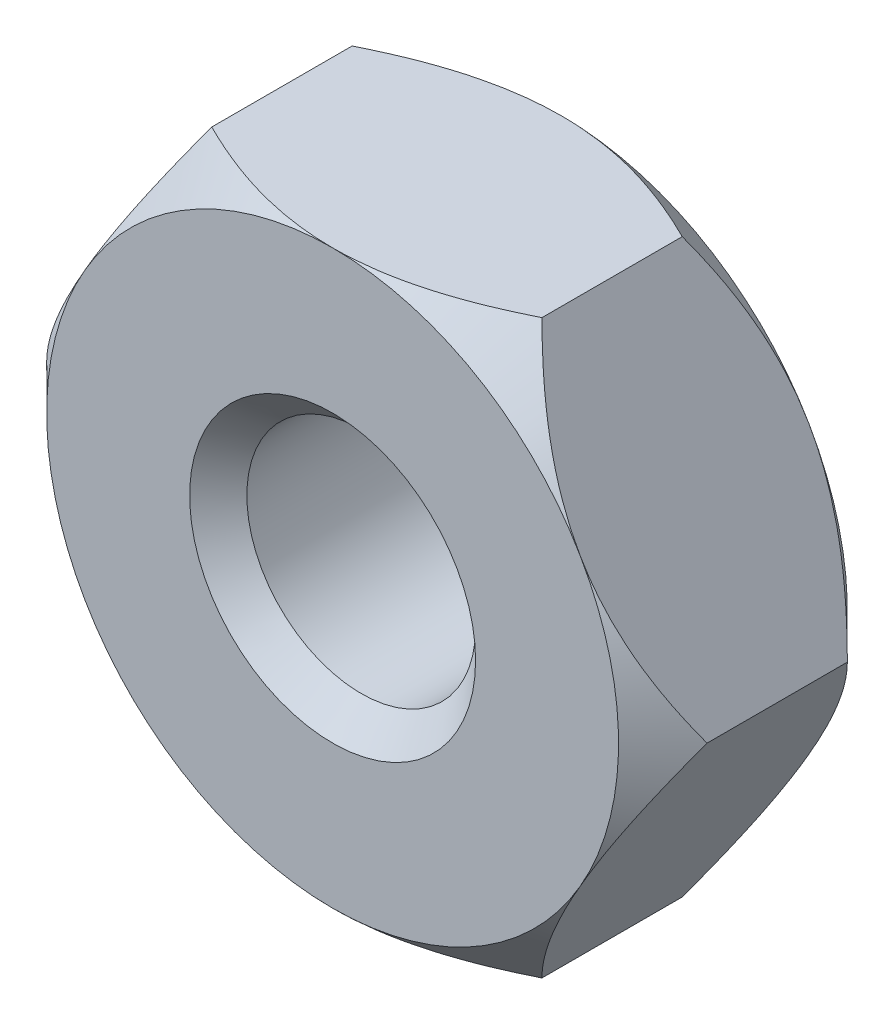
ISO-10303-21;
HEADER;
FILE_DESCRIPTION(('STEP AP214'),'2;1');
FILE_NAME('part.step','',(''),(''),'','','');
FILE_SCHEMA(('AUTOMOTIVE_DESIGN { 1 0 10303 214 1 1 1 1 }'));
ENDSEC;
DATA;
#1=APPLICATION_CONTEXT('core data for automotive mechanical design processes');
#2=APPLICATION_PROTOCOL_DEFINITION('international standard','automotive_design',2000,#1);
#3=PRODUCT_CONTEXT('',#1,'mechanical');
#4=PRODUCT('Part','Part','',(#3));
#5=PRODUCT_RELATED_PRODUCT_CATEGORY('part','',(#4));
#6=PRODUCT_DEFINITION_FORMATION('','',#4);
#7=PRODUCT_DEFINITION_CONTEXT('part definition',#1,'design');
#8=PRODUCT_DEFINITION('design','',#6,#7);
#9=PRODUCT_DEFINITION_SHAPE('','',#8);
#10=(LENGTH_UNIT() NAMED_UNIT(*) SI_UNIT(.MILLI.,.METRE.));
#11=(NAMED_UNIT(*) PLANE_ANGLE_UNIT() SI_UNIT($,.RADIAN.));
#12=(NAMED_UNIT(*) SI_UNIT($,.STERADIAN.) SOLID_ANGLE_UNIT());
#13=UNCERTAINTY_MEASURE_WITH_UNIT(LENGTH_MEASURE(1.E-05),#10,'distance_accuracy_value','');
#14=(GEOMETRIC_REPRESENTATION_CONTEXT(3) GLOBAL_UNCERTAINTY_ASSIGNED_CONTEXT((#13)) GLOBAL_UNIT_ASSIGNED_CONTEXT((#10,
#11,#12)) REPRESENTATION_CONTEXT('',''));
#15=CARTESIAN_POINT('',(0.,0.,0.));
#16=DIRECTION('',(0.,0.,1.));
#17=DIRECTION('',(1.,0.,0.));
#18=AXIS2_PLACEMENT_3D('',#15,#16,#17);
#19=CARTESIAN_POINT('',(1.15470053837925,-2.,0.8));
#20=DIRECTION('',(-0.866025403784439,0.5,0.));
#21=DIRECTION('',(-0.5,-0.866025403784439,0.));
#22=AXIS2_PLACEMENT_3D('',#19,#20,#21);
#23=PLANE('',#22);
#24=DIRECTION('',(0.,0.,-1.));
#25=VECTOR('',#24,1.);
#26=CARTESIAN_POINT('',(1.15470053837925,-2.,0.8));
#27=LINE('',#26,#25);
#28=CARTESIAN_POINT('',(1.15470053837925,-2.,0.490598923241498));
#29=VERTEX_POINT('',#28);
#30=CARTESIAN_POINT('',(1.15470053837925,-2.,-0.490598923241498));
#31=VERTEX_POINT('',#30);
#32=EDGE_CURVE('E268',#29,#31,#27,.T.);
#33=ORIENTED_EDGE('',*,*,#32,.T.);
#34=CARTESIAN_POINT('',(1.15458506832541,-2.0002,-0.490483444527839));
#35=CARTESIAN_POINT('',(1.19427965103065,-1.93144696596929,-0.530145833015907));
#36=CARTESIAN_POINT('',(1.23463799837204,-1.86154425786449,-0.567478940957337));
#37=CARTESIAN_POINT('',(1.31693321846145,-1.71900475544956,-0.635835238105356));
#38=CARTESIAN_POINT('',(1.35887791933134,-1.64635440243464,-0.666820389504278));
#39=CARTESIAN_POINT('',(1.44345742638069,-1.49985839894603,-0.719898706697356));
#40=CARTESIAN_POINT('',(1.48607068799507,-1.42605006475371,-0.742125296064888));
#41=CARTESIAN_POINT('',(1.57223542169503,-1.27680836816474,-0.776370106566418));
#42=CARTESIAN_POINT('',(1.61578426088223,-1.20137956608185,-0.788413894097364));
#43=CARTESIAN_POINT('',(1.69083694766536,-1.07138449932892,-0.799280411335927));
#44=CARTESIAN_POINT('',(1.72224381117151,-1.01698621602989,-0.800889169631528));
#45=CARTESIAN_POINT('',(1.78500621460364,-0.908278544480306,-0.798180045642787));
#46=CARTESIAN_POINT('',(1.81636173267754,-0.85396919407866,-0.793860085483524));
#47=CARTESIAN_POINT('',(1.87877671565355,-0.745863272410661,-0.779539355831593));
#48=CARTESIAN_POINT('',(1.90983580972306,-0.692067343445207,-0.769532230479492));
#49=CARTESIAN_POINT('',(1.97141691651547,-0.585405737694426,-0.744386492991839));
#50=CARTESIAN_POINT('',(2.00193897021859,-0.532539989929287,-0.729248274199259));
#51=CARTESIAN_POINT('',(2.08012358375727,-0.397120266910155,-0.684304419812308));
#52=CARTESIAN_POINT('',(2.12730124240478,-0.315406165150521,-0.651110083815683));
#53=CARTESIAN_POINT('',(2.19667172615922,-0.195252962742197,-0.595073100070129));
#54=CARTESIAN_POINT('',(2.21953238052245,-0.155657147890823,-0.575384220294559));
#55=CARTESIAN_POINT('',(2.26483018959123,-0.0771990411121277,-0.534211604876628));
#56=CARTESIAN_POINT('',(2.28726759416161,-0.0383363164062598,-0.512728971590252));
#57=CARTESIAN_POINT('',(2.30951654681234,0.000199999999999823,-0.490483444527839));
#58=B_SPLINE_CURVE_WITH_KNOTS('',3,(#34,#35,#36,#37,#38,#39,#40,#41,#42,#43,#44,#45,#46,#47,#48,
#49,#50,#51,#52,#53,#54,#55,#56,#57),.UNSPECIFIED.,.F.,.F.,(4,2,2,2,2,2,2,2,2,2,2,4),(0.,
0.266420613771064,0.534393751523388,0.798110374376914,1.06116288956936,1.24939906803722,
1.43770123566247,1.62621426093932,1.81471283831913,2.11415604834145,2.2634717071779,
2.41269626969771),.UNSPECIFIED.);
#59=CARTESIAN_POINT('',(1.73205080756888,-1.,-0.8));
#60=VERTEX_POINT('',#59);
#61=EDGE_CURVE('E60',#31,#60,#58,.T.);
#62=ORIENTED_EDGE('',*,*,#61,.T.);
#63=CARTESIAN_POINT('',(2.3094010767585,0.,-0.490598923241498));
#64=VERTEX_POINT('',#63);
#65=EDGE_CURVE('E148',#60,#64,#58,.T.);
#66=ORIENTED_EDGE('',*,*,#65,.T.);
#67=DIRECTION('',(0.,0.,-1.));
#68=VECTOR('',#67,1.);
#69=CARTESIAN_POINT('',(2.3094010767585,0.,0.8));
#70=LINE('',#69,#68);
#71=CARTESIAN_POINT('',(2.3094010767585,0.,0.490598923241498));
#72=VERTEX_POINT('',#71);
#73=EDGE_CURVE('E162',#72,#64,#70,.T.);
#74=ORIENTED_EDGE('',*,*,#73,.F.);
#75=CARTESIAN_POINT('',(1.15458506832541,-2.0002,0.490483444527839));
#76=CARTESIAN_POINT('',(1.19427965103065,-1.93144696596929,0.530145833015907));
#77=CARTESIAN_POINT('',(1.23463799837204,-1.86154425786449,0.567478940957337));
#78=CARTESIAN_POINT('',(1.31693321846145,-1.71900475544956,0.635835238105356));
#79=CARTESIAN_POINT('',(1.35887791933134,-1.64635440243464,0.666820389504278));
#80=CARTESIAN_POINT('',(1.44345742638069,-1.49985839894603,0.719898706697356));
#81=CARTESIAN_POINT('',(1.48607068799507,-1.42605006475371,0.742125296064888));
#82=CARTESIAN_POINT('',(1.57223542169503,-1.27680836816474,0.776370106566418));
#83=CARTESIAN_POINT('',(1.61578426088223,-1.20137956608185,0.788413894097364));
#84=CARTESIAN_POINT('',(1.69083694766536,-1.07138449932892,0.799280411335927));
#85=CARTESIAN_POINT('',(1.72224381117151,-1.01698621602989,0.800889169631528));
#86=CARTESIAN_POINT('',(1.78500621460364,-0.908278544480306,0.798180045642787));
#87=CARTESIAN_POINT('',(1.81636173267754,-0.85396919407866,0.793860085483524));
#88=CARTESIAN_POINT('',(1.87877671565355,-0.745863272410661,0.779539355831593));
#89=CARTESIAN_POINT('',(1.90983580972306,-0.692067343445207,0.769532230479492));
#90=CARTESIAN_POINT('',(1.97141691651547,-0.585405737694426,0.744386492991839));
#91=CARTESIAN_POINT('',(2.00193897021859,-0.532539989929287,0.729248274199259));
#92=CARTESIAN_POINT('',(2.08012358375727,-0.397120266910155,0.684304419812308));
#93=CARTESIAN_POINT('',(2.12730124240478,-0.315406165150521,0.651110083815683));
#94=CARTESIAN_POINT('',(2.19667172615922,-0.195252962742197,0.595073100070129));
#95=CARTESIAN_POINT('',(2.21953238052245,-0.155657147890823,0.575384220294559));
#96=CARTESIAN_POINT('',(2.26483018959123,-0.0771990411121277,0.534211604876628));
#97=CARTESIAN_POINT('',(2.28726759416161,-0.0383363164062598,0.512728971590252));
#98=CARTESIAN_POINT('',(2.30951654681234,0.000199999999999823,0.490483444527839));
#99=B_SPLINE_CURVE_WITH_KNOTS('',3,(#75,#76,#77,#78,#79,#80,#81,#82,#83,#84,#85,#86,#87,#88,#89,
#90,#91,#92,#93,#94,#95,#96,#97,#98),.UNSPECIFIED.,.F.,.F.,(4,2,2,2,2,2,2,2,2,2,2,4),(0.,
0.266420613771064,0.534393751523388,0.798110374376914,1.06116288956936,1.24939906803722,
1.43770123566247,1.62621426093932,1.81471283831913,2.11415604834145,2.2634717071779,
2.41269626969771),.UNSPECIFIED.);
#100=CARTESIAN_POINT('',(1.73205080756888,-1.,0.8));
#101=VERTEX_POINT('',#100);
#102=EDGE_CURVE('E261',#101,#72,#99,.T.);
#103=ORIENTED_EDGE('',*,*,#102,.F.);
#104=EDGE_CURVE('E267',#29,#101,#99,.T.);
#105=ORIENTED_EDGE('',*,*,#104,.F.);
#106=EDGE_LOOP('',(#33,#62,#66,#74,#103,#105));
#107=FACE_BOUND('',#106,.T.);
#108=ADVANCED_FACE('F41',(#107),#23,.F.);
#109=CARTESIAN_POINT('',(2.3094010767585,0.,0.8));
#110=DIRECTION('',(-0.866025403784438,-0.5,0.));
#111=DIRECTION('',(0.5,-0.866025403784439,0.));
#112=AXIS2_PLACEMENT_3D('',#109,#110,#111);
#113=PLANE('',#112);
#114=ORIENTED_EDGE('',*,*,#73,.T.);
#115=CARTESIAN_POINT('',(2.30951654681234,-0.000199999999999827,-0.490483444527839));
#116=CARTESIAN_POINT('',(2.26982196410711,0.0685530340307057,-0.530145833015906));
#117=CARTESIAN_POINT('',(2.22946361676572,0.138455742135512,-0.567478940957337));
#118=CARTESIAN_POINT('',(2.1471683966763,0.280995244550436,-0.635835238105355));
#119=CARTESIAN_POINT('',(2.10522369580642,0.353645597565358,-0.666820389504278));
#120=CARTESIAN_POINT('',(2.02064418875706,0.500141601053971,-0.719898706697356));
#121=CARTESIAN_POINT('',(1.97803092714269,0.573949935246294,-0.742125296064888));
#122=CARTESIAN_POINT('',(1.89186619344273,0.723191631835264,-0.776370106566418));
#123=CARTESIAN_POINT('',(1.84831735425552,0.798620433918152,-0.788413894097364));
#124=CARTESIAN_POINT('',(1.7732646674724,0.928615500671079,-0.799280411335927));
#125=CARTESIAN_POINT('',(1.74185780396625,0.983013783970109,-0.800889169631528));
#126=CARTESIAN_POINT('',(1.67909540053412,1.09172145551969,-0.798180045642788));
#127=CARTESIAN_POINT('',(1.64773988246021,1.14603080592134,-0.793860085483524));
#128=CARTESIAN_POINT('',(1.5853248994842,1.25413672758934,-0.779539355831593));
#129=CARTESIAN_POINT('',(1.55426580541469,1.30793265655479,-0.769532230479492));
#130=CARTESIAN_POINT('',(1.49268469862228,1.41459426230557,-0.744386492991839));
#131=CARTESIAN_POINT('',(1.46216264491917,1.46746001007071,-0.729248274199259));
#132=CARTESIAN_POINT('',(1.38397803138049,1.60287973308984,-0.684304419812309));
#133=CARTESIAN_POINT('',(1.33680037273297,1.68459383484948,-0.651110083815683));
#134=CARTESIAN_POINT('',(1.26742988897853,1.8047470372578,-0.595073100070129));
#135=CARTESIAN_POINT('',(1.24456923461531,1.84434285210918,-0.575384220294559));
#136=CARTESIAN_POINT('',(1.19927142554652,1.92280095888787,-0.534211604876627));
#137=CARTESIAN_POINT('',(1.17683402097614,1.96166368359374,-0.512728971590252));
#138=CARTESIAN_POINT('',(1.15458506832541,2.0002,-0.490483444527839));
#139=B_SPLINE_CURVE_WITH_KNOTS('',3,(#115,#116,#117,#118,#119,#120,#121,#122,#123,#124,#125,
#126,#127,#128,#129,#130,#131,#132,#133,#134,#135,#136,#137,#138),.UNSPECIFIED.,.F.,.F.,(4,2,2,
2,2,2,2,2,2,2,2,4),(0.,0.266420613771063,0.534393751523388,0.798110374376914,1.06116288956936,
1.24939906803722,1.43770123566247,1.62621426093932,1.81471283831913,2.11415604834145,
2.2634717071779,2.41269626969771),.UNSPECIFIED.);
#140=CARTESIAN_POINT('',(1.73205080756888,1.,-0.8));
#141=VERTEX_POINT('',#140);
#142=EDGE_CURVE('E141',#64,#141,#139,.T.);
#143=ORIENTED_EDGE('',*,*,#142,.T.);
#144=CARTESIAN_POINT('',(1.15470053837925,2.,-0.490598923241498));
#145=VERTEX_POINT('',#144);
#146=EDGE_CURVE('E129',#141,#145,#139,.T.);
#147=ORIENTED_EDGE('',*,*,#146,.T.);
#148=DIRECTION('',(0.,0.,-1.));
#149=VECTOR('',#148,1.);
#150=CARTESIAN_POINT('',(1.15470053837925,2.,0.8));
#151=LINE('',#150,#149);
#152=CARTESIAN_POINT('',(1.15470053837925,2.,0.490598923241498));
#153=VERTEX_POINT('',#152);
#154=EDGE_CURVE('E304',#153,#145,#151,.T.);
#155=ORIENTED_EDGE('',*,*,#154,.F.);
#156=CARTESIAN_POINT('',(2.30951654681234,-0.000199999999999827,0.490483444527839));
#157=CARTESIAN_POINT('',(2.26982196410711,0.0685530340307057,0.530145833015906));
#158=CARTESIAN_POINT('',(2.22946361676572,0.138455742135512,0.567478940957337));
#159=CARTESIAN_POINT('',(2.1471683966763,0.280995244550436,0.635835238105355));
#160=CARTESIAN_POINT('',(2.10522369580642,0.353645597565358,0.666820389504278));
#161=CARTESIAN_POINT('',(2.02064418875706,0.500141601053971,0.719898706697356));
#162=CARTESIAN_POINT('',(1.97803092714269,0.573949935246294,0.742125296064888));
#163=CARTESIAN_POINT('',(1.89186619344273,0.723191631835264,0.776370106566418));
#164=CARTESIAN_POINT('',(1.84831735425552,0.798620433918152,0.788413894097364));
#165=CARTESIAN_POINT('',(1.7732646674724,0.928615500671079,0.799280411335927));
#166=CARTESIAN_POINT('',(1.74185780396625,0.983013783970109,0.800889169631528));
#167=CARTESIAN_POINT('',(1.67909540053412,1.09172145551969,0.798180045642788));
#168=CARTESIAN_POINT('',(1.64773988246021,1.14603080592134,0.793860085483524));
#169=CARTESIAN_POINT('',(1.5853248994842,1.25413672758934,0.779539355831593));
#170=CARTESIAN_POINT('',(1.55426580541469,1.30793265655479,0.769532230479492));
#171=CARTESIAN_POINT('',(1.49268469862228,1.41459426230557,0.744386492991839));
#172=CARTESIAN_POINT('',(1.46216264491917,1.46746001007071,0.729248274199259));
#173=CARTESIAN_POINT('',(1.38397803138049,1.60287973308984,0.684304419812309));
#174=CARTESIAN_POINT('',(1.33680037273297,1.68459383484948,0.651110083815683));
#175=CARTESIAN_POINT('',(1.26742988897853,1.8047470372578,0.595073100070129));
#176=CARTESIAN_POINT('',(1.24456923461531,1.84434285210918,0.575384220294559));
#177=CARTESIAN_POINT('',(1.19927142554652,1.92280095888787,0.534211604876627));
#178=CARTESIAN_POINT('',(1.17683402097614,1.96166368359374,0.512728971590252));
#179=CARTESIAN_POINT('',(1.15458506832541,2.0002,0.490483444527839));
#180=B_SPLINE_CURVE_WITH_KNOTS('',3,(#156,#157,#158,#159,#160,#161,#162,#163,#164,#165,#166,
#167,#168,#169,#170,#171,#172,#173,#174,#175,#176,#177,#178,#179),.UNSPECIFIED.,.F.,.F.,(4,2,2,
2,2,2,2,2,2,2,2,4),(0.,0.266420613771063,0.534393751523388,0.798110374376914,1.06116288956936,
1.24939906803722,1.43770123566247,1.62621426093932,1.81471283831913,2.11415604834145,
2.2634717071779,2.41269626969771),.UNSPECIFIED.);
#181=CARTESIAN_POINT('',(1.73205080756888,1.,0.8));
#182=VERTEX_POINT('',#181);
#183=EDGE_CURVE('E254',#182,#153,#180,.T.);
#184=ORIENTED_EDGE('',*,*,#183,.F.);
#185=EDGE_CURVE('E260',#72,#182,#180,.T.);
#186=ORIENTED_EDGE('',*,*,#185,.F.);
#187=EDGE_LOOP('',(#114,#143,#147,#155,#184,#186));
#188=FACE_BOUND('',#187,.T.);
#189=ADVANCED_FACE('F159',(#188),#113,.F.);
#190=CARTESIAN_POINT('',(1.15470053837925,2.,0.8));
#191=DIRECTION('',(0.,-1.,0.));
#192=DIRECTION('',(0.,0.,-1.));
#193=AXIS2_PLACEMENT_3D('',#190,#191,#192);
#194=PLANE('',#193);
#195=ORIENTED_EDGE('',*,*,#154,.T.);
#196=CARTESIAN_POINT('',(-2.61254327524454,2.,0.49019488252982));
#197=CARTESIAN_POINT('',(-2.55012778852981,2.,0.440645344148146));
#198=CARTESIAN_POINT('',(-2.48740009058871,2.,0.391483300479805));
#199=CARTESIAN_POINT('',(-2.36118487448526,2.,0.294117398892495));
#200=CARTESIAN_POINT('',(-2.29769719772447,2.,0.245913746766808));
#201=CARTESIAN_POINT('',(-2.16936780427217,2.,0.150307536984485));
#202=CARTESIAN_POINT('',(-2.10451946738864,2.,0.102913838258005));
#203=CARTESIAN_POINT('',(-1.97378837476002,2.,0.00958078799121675));
#204=CARTESIAN_POINT('',(-1.90790568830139,2.,-0.0363586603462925));
#205=CARTESIAN_POINT('',(-1.76987564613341,2.,-0.129852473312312));
#206=CARTESIAN_POINT('',(-1.69763195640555,2.,-0.177265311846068));
#207=CARTESIAN_POINT('',(-1.55146442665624,2.,-0.269422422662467));
#208=CARTESIAN_POINT('',(-1.47754080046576,2.,-0.314167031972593));
#209=CARTESIAN_POINT('',(-1.32791120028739,2.,-0.400082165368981));
#210=CARTESIAN_POINT('',(-1.25221093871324,2.,-0.441262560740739));
#211=CARTESIAN_POINT('',(-1.09854641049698,2.,-0.519118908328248));
#212=CARTESIAN_POINT('',(-1.02058330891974,2.,-0.555797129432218));
#213=CARTESIAN_POINT('',(-0.872237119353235,2.,-0.618970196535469));
#214=CARTESIAN_POINT('',(-0.802156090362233,2.,-0.646167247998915));
#215=CARTESIAN_POINT('',(-0.660033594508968,2.,-0.694959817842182));
#216=CARTESIAN_POINT('',(-0.587992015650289,2.,-0.716555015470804));
#217=CARTESIAN_POINT('',(-0.443748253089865,2.,-0.752526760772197));
#218=CARTESIAN_POINT('',(-0.371583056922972,2.,-0.767048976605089));
#219=CARTESIAN_POINT('',(-0.226130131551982,2.,-0.788539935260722));
#220=CARTESIAN_POINT('',(-0.152842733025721,2.,-0.795510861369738));
#221=CARTESIAN_POINT('',(-0.0103634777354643,2.,-0.801163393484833));
#222=CARTESIAN_POINT('',(0.0588095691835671,2.,-0.800318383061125));
#223=CARTESIAN_POINT('',(0.196699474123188,2.,-0.791529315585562));
#224=CARTESIAN_POINT('',(0.265416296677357,2.,-0.783584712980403));
#225=CARTESIAN_POINT('',(0.403074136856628,2.,-0.760940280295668));
#226=CARTESIAN_POINT('',(0.47199376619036,2.,-0.746112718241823));
#227=CARTESIAN_POINT('',(0.608270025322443,2.,-0.710583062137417));
#228=CARTESIAN_POINT('',(0.675626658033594,2.,-0.689880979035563));
#229=CARTESIAN_POINT('',(0.875863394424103,2.,-0.620234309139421));
#230=CARTESIAN_POINT('',(1.00615820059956,2.,-0.563893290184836));
#231=CARTESIAN_POINT('',(1.26069744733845,2.,-0.438429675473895));
#232=CARTESIAN_POINT('',(1.38491927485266,2.,-0.369263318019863));
#233=CARTESIAN_POINT('',(1.56449502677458,2.,-0.261192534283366));
#234=CARTESIAN_POINT('',(1.62178989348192,2.,-0.22544809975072));
#235=CARTESIAN_POINT('',(1.73539571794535,2.,-0.152416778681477));
#236=CARTESIAN_POINT('',(1.79170660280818,2.,-0.115129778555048));
#237=CARTESIAN_POINT('',(1.90302512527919,2.,-0.0395931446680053));
#238=CARTESIAN_POINT('',(1.95803954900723,2.,-0.00135346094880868));
#239=CARTESIAN_POINT('',(2.0673116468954,2.,0.076162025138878));
#240=CARTESIAN_POINT('',(2.12156952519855,2.,0.115437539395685));
#241=CARTESIAN_POINT('',(2.17550963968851,2.,0.155138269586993));
#242=B_SPLINE_CURVE_WITH_KNOTS('',3,(#196,#197,#198,#199,#200,#201,#202,#203,#204,#205,#206,
#207,#208,#209,#210,#211,#212,#213,#214,#215,#216,#217,#218,#219,#220,#221,#222,#223,#224,#225,
#226,#227,#228,#229,#230,#231,#232,#233,#234,#235,#236,#237,#238,#239,#240,#241),.UNSPECIFIED.,
.F.,.F.,(4,2,2,2,2,2,2,2,2,2,2,2,2,2,2,2,2,2,2,2,2,2,4),(0.,0.239080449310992,0.478211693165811,
0.719158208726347,0.960088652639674,1.21928095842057,1.47844045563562,1.73685755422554,
1.99514388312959,2.22047513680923,2.44581928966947,2.66630243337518,2.88672181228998,
3.09388290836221,3.30105992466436,3.51224559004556,3.72343086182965,4.14807332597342,
4.57419231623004,4.77676462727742,4.9793518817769,5.18033632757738,5.38126544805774),.UNSPECIFIED.);
#243=CARTESIAN_POINT('',(0.,2.,-0.8));
#244=VERTEX_POINT('',#243);
#245=EDGE_CURVE('E136',#145,#244,#242,.F.);
#246=ORIENTED_EDGE('',*,*,#245,.T.);
#247=CARTESIAN_POINT('',(-1.15470053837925,2.,-0.490598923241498));
#248=VERTEX_POINT('',#247);
#249=EDGE_CURVE('E171',#244,#248,#242,.F.);
#250=ORIENTED_EDGE('',*,*,#249,.T.);
#251=DIRECTION('',(0.,0.,-1.));
#252=VECTOR('',#251,1.);
#253=CARTESIAN_POINT('',(-1.15470053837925,2.,0.8));
#254=LINE('',#253,#252);
#255=CARTESIAN_POINT('',(-1.15470053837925,2.,0.490598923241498));
#256=VERTEX_POINT('',#255);
#257=EDGE_CURVE('E306',#256,#248,#254,.T.);
#258=ORIENTED_EDGE('',*,*,#257,.F.);
#259=CARTESIAN_POINT('',(-2.61254327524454,2.,-0.49019488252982));
#260=CARTESIAN_POINT('',(-2.55012778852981,2.,-0.440645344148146));
#261=CARTESIAN_POINT('',(-2.48740009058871,2.,-0.391483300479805));
#262=CARTESIAN_POINT('',(-2.36118487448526,2.,-0.294117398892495));
#263=CARTESIAN_POINT('',(-2.29769719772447,2.,-0.245913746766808));
#264=CARTESIAN_POINT('',(-2.16936780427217,2.,-0.150307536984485));
#265=CARTESIAN_POINT('',(-2.10451946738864,2.,-0.102913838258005));
#266=CARTESIAN_POINT('',(-1.97378837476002,2.,-0.00958078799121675));
#267=CARTESIAN_POINT('',(-1.90790568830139,2.,0.0363586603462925));
#268=CARTESIAN_POINT('',(-1.76987564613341,2.,0.129852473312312));
#269=CARTESIAN_POINT('',(-1.69763195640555,2.,0.177265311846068));
#270=CARTESIAN_POINT('',(-1.55146442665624,2.,0.269422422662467));
#271=CARTESIAN_POINT('',(-1.47754080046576,2.,0.314167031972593));
#272=CARTESIAN_POINT('',(-1.32791120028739,2.,0.400082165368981));
#273=CARTESIAN_POINT('',(-1.25221093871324,2.,0.441262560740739));
#274=CARTESIAN_POINT('',(-1.09854641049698,2.,0.519118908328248));
#275=CARTESIAN_POINT('',(-1.02058330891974,2.,0.555797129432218));
#276=CARTESIAN_POINT('',(-0.872237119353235,2.,0.618970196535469));
#277=CARTESIAN_POINT('',(-0.802156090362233,2.,0.646167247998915));
#278=CARTESIAN_POINT('',(-0.660033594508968,2.,0.694959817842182));
#279=CARTESIAN_POINT('',(-0.587992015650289,2.,0.716555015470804));
#280=CARTESIAN_POINT('',(-0.443748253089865,2.,0.752526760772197));
#281=CARTESIAN_POINT('',(-0.371583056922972,2.,0.767048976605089));
#282=CARTESIAN_POINT('',(-0.226130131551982,2.,0.788539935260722));
#283=CARTESIAN_POINT('',(-0.152842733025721,2.,0.795510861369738));
#284=CARTESIAN_POINT('',(-0.0103634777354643,2.,0.801163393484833));
#285=CARTESIAN_POINT('',(0.0588095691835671,2.,0.800318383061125));
#286=CARTESIAN_POINT('',(0.196699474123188,2.,0.791529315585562));
#287=CARTESIAN_POINT('',(0.265416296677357,2.,0.783584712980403));
#288=CARTESIAN_POINT('',(0.403074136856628,2.,0.760940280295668));
#289=CARTESIAN_POINT('',(0.47199376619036,2.,0.746112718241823));
#290=CARTESIAN_POINT('',(0.608270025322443,2.,0.710583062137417));
#291=CARTESIAN_POINT('',(0.675626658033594,2.,0.689880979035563));
#292=CARTESIAN_POINT('',(0.875863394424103,2.,0.620234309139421));
#293=CARTESIAN_POINT('',(1.00615820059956,2.,0.563893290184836));
#294=CARTESIAN_POINT('',(1.26069744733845,2.,0.438429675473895));
#295=CARTESIAN_POINT('',(1.38491927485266,2.,0.369263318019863));
#296=CARTESIAN_POINT('',(1.56449502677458,2.,0.261192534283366));
#297=CARTESIAN_POINT('',(1.62178989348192,2.,0.22544809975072));
#298=CARTESIAN_POINT('',(1.73539571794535,2.,0.152416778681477));
#299=CARTESIAN_POINT('',(1.79170660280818,2.,0.115129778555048));
#300=CARTESIAN_POINT('',(1.90302512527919,2.,0.0395931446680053));
#301=CARTESIAN_POINT('',(1.95803954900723,2.,0.00135346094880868));
#302=CARTESIAN_POINT('',(2.0673116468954,2.,-0.076162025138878));
#303=CARTESIAN_POINT('',(2.12156952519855,2.,-0.115437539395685));
#304=CARTESIAN_POINT('',(2.17550963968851,2.,-0.155138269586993));
#305=B_SPLINE_CURVE_WITH_KNOTS('',3,(#259,#260,#261,#262,#263,#264,#265,#266,#267,#268,#269,
#270,#271,#272,#273,#274,#275,#276,#277,#278,#279,#280,#281,#282,#283,#284,#285,#286,#287,#288,
#289,#290,#291,#292,#293,#294,#295,#296,#297,#298,#299,#300,#301,#302,#303,#304),.UNSPECIFIED.,
.F.,.F.,(4,2,2,2,2,2,2,2,2,2,2,2,2,2,2,2,2,2,2,2,2,2,4),(0.,0.239080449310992,0.478211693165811,
0.719158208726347,0.960088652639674,1.21928095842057,1.47844045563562,1.73685755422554,
1.99514388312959,2.22047513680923,2.44581928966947,2.66630243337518,2.88672181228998,
3.09388290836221,3.30105992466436,3.51224559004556,3.72343086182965,4.14807332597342,
4.57419231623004,4.77676462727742,4.9793518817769,5.18033632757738,5.38126544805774),.UNSPECIFIED.);
#306=CARTESIAN_POINT('',(0.,2.,0.8));
#307=VERTEX_POINT('',#306);
#308=EDGE_CURVE('E247',#307,#256,#305,.F.);
#309=ORIENTED_EDGE('',*,*,#308,.F.);
#310=EDGE_CURVE('E253',#153,#307,#305,.F.);
#311=ORIENTED_EDGE('',*,*,#310,.F.);
#312=EDGE_LOOP('',(#195,#246,#250,#258,#309,#311));
#313=FACE_BOUND('',#312,.T.);
#314=ADVANCED_FACE('F226',(#313),#194,.F.);
#315=CARTESIAN_POINT('',(-1.15470053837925,2.,0.8));
#316=DIRECTION('',(0.866025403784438,-0.5,0.));
#317=DIRECTION('',(0.5,0.866025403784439,0.));
#318=AXIS2_PLACEMENT_3D('',#315,#316,#317);
#319=PLANE('',#318);
#320=ORIENTED_EDGE('',*,*,#257,.T.);
#321=CARTESIAN_POINT('',(-1.15458506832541,2.0002,-0.490483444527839));
#322=CARTESIAN_POINT('',(-1.19427965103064,1.93144696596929,-0.530145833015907));
#323=CARTESIAN_POINT('',(-1.23463799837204,1.86154425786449,-0.567478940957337));
#324=CARTESIAN_POINT('',(-1.31693321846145,1.71900475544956,-0.635835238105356));
#325=CARTESIAN_POINT('',(-1.35887791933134,1.64635440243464,-0.666820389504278));
#326=CARTESIAN_POINT('',(-1.44345742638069,1.49985839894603,-0.719898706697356));
#327=CARTESIAN_POINT('',(-1.48607068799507,1.42605006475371,-0.742125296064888));
#328=CARTESIAN_POINT('',(-1.57223542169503,1.27680836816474,-0.776370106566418));
#329=CARTESIAN_POINT('',(-1.61578426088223,1.20137956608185,-0.788413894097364));
#330=CARTESIAN_POINT('',(-1.69083694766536,1.07138449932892,-0.799280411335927));
#331=CARTESIAN_POINT('',(-1.72224381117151,1.01698621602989,-0.800889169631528));
#332=CARTESIAN_POINT('',(-1.78500621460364,0.908278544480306,-0.798180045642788));
#333=CARTESIAN_POINT('',(-1.81636173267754,0.853969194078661,-0.793860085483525));
#334=CARTESIAN_POINT('',(-1.87877671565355,0.745863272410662,-0.779539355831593));
#335=CARTESIAN_POINT('',(-1.90983580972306,0.692067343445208,-0.769532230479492));
#336=CARTESIAN_POINT('',(-1.97141691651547,0.585405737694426,-0.744386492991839));
#337=CARTESIAN_POINT('',(-2.00193897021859,0.532539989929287,-0.729248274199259));
#338=CARTESIAN_POINT('',(-2.08012358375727,0.397120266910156,-0.684304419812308));
#339=CARTESIAN_POINT('',(-2.12730124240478,0.315406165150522,-0.651110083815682));
#340=CARTESIAN_POINT('',(-2.19667172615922,0.195252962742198,-0.595073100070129));
#341=CARTESIAN_POINT('',(-2.21953238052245,0.155657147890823,-0.575384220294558));
#342=CARTESIAN_POINT('',(-2.26483018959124,0.0771990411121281,-0.534211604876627));
#343=CARTESIAN_POINT('',(-2.28726759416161,0.0383363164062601,-0.512728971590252));
#344=CARTESIAN_POINT('',(-2.30951654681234,-0.000199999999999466,-0.490483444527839));
#345=B_SPLINE_CURVE_WITH_KNOTS('',3,(#321,#322,#323,#324,#325,#326,#327,#328,#329,#330,#331,
#332,#333,#334,#335,#336,#337,#338,#339,#340,#341,#342,#343,#344),.UNSPECIFIED.,.F.,.F.,(4,2,2,
2,2,2,2,2,2,2,2,4),(0.,0.266420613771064,0.534393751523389,0.798110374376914,1.06116288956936,
1.24939906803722,1.43770123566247,1.62621426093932,1.81471283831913,2.11415604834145,
2.2634717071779,2.41269626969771),.UNSPECIFIED.);
#346=CARTESIAN_POINT('',(-1.73205080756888,1.,-0.8));
#347=VERTEX_POINT('',#346);
#348=EDGE_CURVE('E220',#248,#347,#345,.T.);
#349=ORIENTED_EDGE('',*,*,#348,.T.);
#350=CARTESIAN_POINT('',(-2.3094010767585,0.,-0.490598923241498));
#351=VERTEX_POINT('',#350);
#352=EDGE_CURVE('E213',#347,#351,#345,.T.);
#353=ORIENTED_EDGE('',*,*,#352,.T.);
#354=DIRECTION('',(0.,0.,-1.));
#355=VECTOR('',#354,1.);
#356=CARTESIAN_POINT('',(-2.3094010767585,0.,0.8));
#357=LINE('',#356,#355);
#358=CARTESIAN_POINT('',(-2.3094010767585,0.,0.490598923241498));
#359=VERTEX_POINT('',#358);
#360=EDGE_CURVE('E309',#359,#351,#357,.T.);
#361=ORIENTED_EDGE('',*,*,#360,.F.);
#362=CARTESIAN_POINT('',(-1.15458506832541,2.0002,0.490483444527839));
#363=CARTESIAN_POINT('',(-1.19427965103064,1.93144696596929,0.530145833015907));
#364=CARTESIAN_POINT('',(-1.23463799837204,1.86154425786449,0.567478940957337));
#365=CARTESIAN_POINT('',(-1.31693321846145,1.71900475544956,0.635835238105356));
#366=CARTESIAN_POINT('',(-1.35887791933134,1.64635440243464,0.666820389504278));
#367=CARTESIAN_POINT('',(-1.44345742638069,1.49985839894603,0.719898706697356));
#368=CARTESIAN_POINT('',(-1.48607068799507,1.42605006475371,0.742125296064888));
#369=CARTESIAN_POINT('',(-1.57223542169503,1.27680836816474,0.776370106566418));
#370=CARTESIAN_POINT('',(-1.61578426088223,1.20137956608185,0.788413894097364));
#371=CARTESIAN_POINT('',(-1.69083694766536,1.07138449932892,0.799280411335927));
#372=CARTESIAN_POINT('',(-1.72224381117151,1.01698621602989,0.800889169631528));
#373=CARTESIAN_POINT('',(-1.78500621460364,0.908278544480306,0.798180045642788));
#374=CARTESIAN_POINT('',(-1.81636173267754,0.853969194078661,0.793860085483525));
#375=CARTESIAN_POINT('',(-1.87877671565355,0.745863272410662,0.779539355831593));
#376=CARTESIAN_POINT('',(-1.90983580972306,0.692067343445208,0.769532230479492));
#377=CARTESIAN_POINT('',(-1.97141691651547,0.585405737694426,0.744386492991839));
#378=CARTESIAN_POINT('',(-2.00193897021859,0.532539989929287,0.729248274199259));
#379=CARTESIAN_POINT('',(-2.08012358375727,0.397120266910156,0.684304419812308));
#380=CARTESIAN_POINT('',(-2.12730124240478,0.315406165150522,0.651110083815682));
#381=CARTESIAN_POINT('',(-2.19667172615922,0.195252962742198,0.595073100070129));
#382=CARTESIAN_POINT('',(-2.21953238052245,0.155657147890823,0.575384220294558));
#383=CARTESIAN_POINT('',(-2.26483018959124,0.0771990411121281,0.534211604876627));
#384=CARTESIAN_POINT('',(-2.28726759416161,0.0383363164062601,0.512728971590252));
#385=CARTESIAN_POINT('',(-2.30951654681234,-0.000199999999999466,0.490483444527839));
#386=B_SPLINE_CURVE_WITH_KNOTS('',3,(#362,#363,#364,#365,#366,#367,#368,#369,#370,#371,#372,
#373,#374,#375,#376,#377,#378,#379,#380,#381,#382,#383,#384,#385),.UNSPECIFIED.,.F.,.F.,(4,2,2,
2,2,2,2,2,2,2,2,4),(0.,0.266420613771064,0.534393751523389,0.798110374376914,1.06116288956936,
1.24939906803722,1.43770123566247,1.62621426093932,1.81471283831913,2.11415604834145,
2.2634717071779,2.41269626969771),.UNSPECIFIED.);
#387=CARTESIAN_POINT('',(-1.73205080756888,1.,0.8));
#388=VERTEX_POINT('',#387);
#389=EDGE_CURVE('E232',#388,#359,#386,.T.);
#390=ORIENTED_EDGE('',*,*,#389,.F.);
#391=EDGE_CURVE('E239',#256,#388,#386,.T.);
#392=ORIENTED_EDGE('',*,*,#391,.F.);
#393=EDGE_LOOP('',(#320,#349,#353,#361,#390,#392));
#394=FACE_BOUND('',#393,.T.);
#395=ADVANCED_FACE('F222',(#394),#319,.F.);
#396=CARTESIAN_POINT('',(-2.3094010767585,0.,0.8));
#397=DIRECTION('',(0.866025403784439,0.5,0.));
#398=DIRECTION('',(-0.5,0.866025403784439,0.));
#399=AXIS2_PLACEMENT_3D('',#396,#397,#398);
#400=PLANE('',#399);
#401=ORIENTED_EDGE('',*,*,#360,.T.);
#402=CARTESIAN_POINT('',(-2.30951654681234,0.000200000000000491,-0.490483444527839));
#403=CARTESIAN_POINT('',(-2.26982196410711,-0.0685530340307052,-0.530145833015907));
#404=CARTESIAN_POINT('',(-2.22946361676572,-0.138455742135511,-0.567478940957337));
#405=CARTESIAN_POINT('',(-2.1471683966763,-0.280995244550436,-0.635835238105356));
#406=CARTESIAN_POINT('',(-2.10522369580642,-0.353645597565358,-0.666820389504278));
#407=CARTESIAN_POINT('',(-2.02064418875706,-0.500141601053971,-0.719898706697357));
#408=CARTESIAN_POINT('',(-1.97803092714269,-0.573949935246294,-0.742125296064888));
#409=CARTESIAN_POINT('',(-1.89186619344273,-0.723191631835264,-0.776370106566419));
#410=CARTESIAN_POINT('',(-1.84831735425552,-0.798620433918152,-0.788413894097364));
#411=CARTESIAN_POINT('',(-1.7732646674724,-0.92861550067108,-0.799280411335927));
#412=CARTESIAN_POINT('',(-1.74185780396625,-0.983013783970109,-0.800889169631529));
#413=CARTESIAN_POINT('',(-1.67909540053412,-1.09172145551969,-0.798180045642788));
#414=CARTESIAN_POINT('',(-1.64773988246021,-1.14603080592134,-0.793860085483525));
#415=CARTESIAN_POINT('',(-1.5853248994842,-1.25413672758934,-0.779539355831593));
#416=CARTESIAN_POINT('',(-1.55426580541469,-1.30793265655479,-0.769532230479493));
#417=CARTESIAN_POINT('',(-1.49268469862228,-1.41459426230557,-0.74438649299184));
#418=CARTESIAN_POINT('',(-1.46216264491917,-1.46746001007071,-0.729248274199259));
#419=CARTESIAN_POINT('',(-1.38397803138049,-1.60287973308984,-0.684304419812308));
#420=CARTESIAN_POINT('',(-1.33680037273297,-1.68459383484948,-0.651110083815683));
#421=CARTESIAN_POINT('',(-1.26742988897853,-1.8047470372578,-0.595073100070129));
#422=CARTESIAN_POINT('',(-1.24456923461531,-1.84434285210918,-0.575384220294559));
#423=CARTESIAN_POINT('',(-1.19927142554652,-1.92280095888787,-0.534211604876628));
#424=CARTESIAN_POINT('',(-1.17683402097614,-1.96166368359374,-0.512728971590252));
#425=CARTESIAN_POINT('',(-1.15458506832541,-2.0002,-0.49048344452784));
#426=B_SPLINE_CURVE_WITH_KNOTS('',3,(#402,#403,#404,#405,#406,#407,#408,#409,#410,#411,#412,
#413,#414,#415,#416,#417,#418,#419,#420,#421,#422,#423,#424,#425),.UNSPECIFIED.,.F.,.F.,(4,2,2,
2,2,2,2,2,2,2,2,4),(0.,0.266420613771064,0.534393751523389,0.798110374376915,1.06116288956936,
1.24939906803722,1.43770123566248,1.62621426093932,1.81471283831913,2.11415604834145,
2.26347170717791,2.41269626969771),.UNSPECIFIED.);
#427=CARTESIAN_POINT('',(-1.73205080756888,-1.,-0.8));
#428=VERTEX_POINT('',#427);
#429=EDGE_CURVE('E221',#351,#428,#426,.T.);
#430=ORIENTED_EDGE('',*,*,#429,.T.);
#431=CARTESIAN_POINT('',(-1.15470053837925,-2.,-0.490598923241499));
#432=VERTEX_POINT('',#431);
#433=EDGE_CURVE('E207',#428,#432,#426,.T.);
#434=ORIENTED_EDGE('',*,*,#433,.T.);
#435=DIRECTION('',(0.,0.,-1.));
#436=VECTOR('',#435,1.);
#437=CARTESIAN_POINT('',(-1.15470053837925,-2.,0.8));
#438=LINE('',#437,#436);
#439=CARTESIAN_POINT('',(-1.15470053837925,-2.,0.490598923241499));
#440=VERTEX_POINT('',#439);
#441=EDGE_CURVE('E311',#440,#432,#438,.T.);
#442=ORIENTED_EDGE('',*,*,#441,.F.);
#443=CARTESIAN_POINT('',(-2.30951654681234,0.000200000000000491,0.490483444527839));
#444=CARTESIAN_POINT('',(-2.26982196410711,-0.0685530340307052,0.530145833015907));
#445=CARTESIAN_POINT('',(-2.22946361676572,-0.138455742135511,0.567478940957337));
#446=CARTESIAN_POINT('',(-2.1471683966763,-0.280995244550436,0.635835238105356));
#447=CARTESIAN_POINT('',(-2.10522369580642,-0.353645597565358,0.666820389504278));
#448=CARTESIAN_POINT('',(-2.02064418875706,-0.500141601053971,0.719898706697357));
#449=CARTESIAN_POINT('',(-1.97803092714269,-0.573949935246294,0.742125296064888));
#450=CARTESIAN_POINT('',(-1.89186619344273,-0.723191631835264,0.776370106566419));
#451=CARTESIAN_POINT('',(-1.84831735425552,-0.798620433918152,0.788413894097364));
#452=CARTESIAN_POINT('',(-1.7732646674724,-0.92861550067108,0.799280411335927));
#453=CARTESIAN_POINT('',(-1.74185780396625,-0.983013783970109,0.800889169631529));
#454=CARTESIAN_POINT('',(-1.67909540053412,-1.09172145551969,0.798180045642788));
#455=CARTESIAN_POINT('',(-1.64773988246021,-1.14603080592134,0.793860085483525));
#456=CARTESIAN_POINT('',(-1.5853248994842,-1.25413672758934,0.779539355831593));
#457=CARTESIAN_POINT('',(-1.55426580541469,-1.30793265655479,0.769532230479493));
#458=CARTESIAN_POINT('',(-1.49268469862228,-1.41459426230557,0.74438649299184));
#459=CARTESIAN_POINT('',(-1.46216264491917,-1.46746001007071,0.729248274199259));
#460=CARTESIAN_POINT('',(-1.38397803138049,-1.60287973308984,0.684304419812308));
#461=CARTESIAN_POINT('',(-1.33680037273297,-1.68459383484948,0.651110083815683));
#462=CARTESIAN_POINT('',(-1.26742988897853,-1.8047470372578,0.595073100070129));
#463=CARTESIAN_POINT('',(-1.24456923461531,-1.84434285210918,0.575384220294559));
#464=CARTESIAN_POINT('',(-1.19927142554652,-1.92280095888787,0.534211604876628));
#465=CARTESIAN_POINT('',(-1.17683402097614,-1.96166368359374,0.512728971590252));
#466=CARTESIAN_POINT('',(-1.15458506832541,-2.0002,0.49048344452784));
#467=B_SPLINE_CURVE_WITH_KNOTS('',3,(#443,#444,#445,#446,#447,#448,#449,#450,#451,#452,#453,
#454,#455,#456,#457,#458,#459,#460,#461,#462,#463,#464,#465,#466),.UNSPECIFIED.,.F.,.F.,(4,2,2,
2,2,2,2,2,2,2,2,4),(0.,0.266420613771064,0.534393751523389,0.798110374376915,1.06116288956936,
1.24939906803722,1.43770123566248,1.62621426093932,1.81471283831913,2.11415604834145,
2.26347170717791,2.41269626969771),.UNSPECIFIED.);
#468=CARTESIAN_POINT('',(-1.73205080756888,-1.,0.8));
#469=VERTEX_POINT('',#468);
#470=EDGE_CURVE('E241',#469,#440,#467,.T.);
#471=ORIENTED_EDGE('',*,*,#470,.F.);
#472=EDGE_CURVE('E240',#359,#469,#467,.T.);
#473=ORIENTED_EDGE('',*,*,#472,.F.);
#474=EDGE_LOOP('',(#401,#430,#434,#442,#471,#473));
#475=FACE_BOUND('',#474,.T.);
#476=ADVANCED_FACE('F225',(#475),#400,.F.);
#477=CARTESIAN_POINT('',(-1.15470053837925,-2.,0.8));
#478=DIRECTION('',(0.,1.,0.));
#479=DIRECTION('',(0.,0.,1.));
#480=AXIS2_PLACEMENT_3D('',#477,#478,#479);
#481=PLANE('',#480);
#482=ORIENTED_EDGE('',*,*,#441,.T.);
#483=CARTESIAN_POINT('',(-2.61254327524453,-2.,0.490194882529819));
#484=CARTESIAN_POINT('',(-2.55012778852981,-2.,0.440645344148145));
#485=CARTESIAN_POINT('',(-2.48740009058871,-2.,0.391483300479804));
#486=CARTESIAN_POINT('',(-2.36118487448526,-2.,0.294117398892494));
#487=CARTESIAN_POINT('',(-2.29769719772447,-2.,0.245913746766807));
#488=CARTESIAN_POINT('',(-2.16936780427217,-2.,0.150307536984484));
#489=CARTESIAN_POINT('',(-2.10451946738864,-2.,0.102913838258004));
#490=CARTESIAN_POINT('',(-1.97378837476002,-2.,0.00958078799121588));
#491=CARTESIAN_POINT('',(-1.90790568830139,-2.,-0.0363586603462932));
#492=CARTESIAN_POINT('',(-1.76987564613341,-2.,-0.129852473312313));
#493=CARTESIAN_POINT('',(-1.69763195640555,-2.,-0.177265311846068));
#494=CARTESIAN_POINT('',(-1.55146442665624,-2.,-0.269422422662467));
#495=CARTESIAN_POINT('',(-1.47754080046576,-2.,-0.314167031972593));
#496=CARTESIAN_POINT('',(-1.32791120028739,-2.,-0.400082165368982));
#497=CARTESIAN_POINT('',(-1.25221093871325,-2.,-0.441262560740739));
#498=CARTESIAN_POINT('',(-1.09854641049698,-2.,-0.519118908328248));
#499=CARTESIAN_POINT('',(-1.02058330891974,-2.,-0.555797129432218));
#500=CARTESIAN_POINT('',(-0.872237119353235,-2.,-0.618970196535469));
#501=CARTESIAN_POINT('',(-0.802156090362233,-2.,-0.646167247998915));
#502=CARTESIAN_POINT('',(-0.660033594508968,-2.,-0.694959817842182));
#503=CARTESIAN_POINT('',(-0.587992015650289,-2.,-0.716555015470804));
#504=CARTESIAN_POINT('',(-0.443748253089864,-2.,-0.752526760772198));
#505=CARTESIAN_POINT('',(-0.371583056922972,-2.,-0.76704897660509));
#506=CARTESIAN_POINT('',(-0.226130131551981,-2.,-0.788539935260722));
#507=CARTESIAN_POINT('',(-0.15284273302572,-2.,-0.795510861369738));
#508=CARTESIAN_POINT('',(-0.0103634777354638,-2.,-0.801163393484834));
#509=CARTESIAN_POINT('',(0.0588095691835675,-2.,-0.800318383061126));
#510=CARTESIAN_POINT('',(0.196699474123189,-2.,-0.791529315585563));
#511=CARTESIAN_POINT('',(0.265416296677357,-2.,-0.783584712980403));
#512=CARTESIAN_POINT('',(0.403074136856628,-2.,-0.760940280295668));
#513=CARTESIAN_POINT('',(0.47199376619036,-2.,-0.746112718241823));
#514=CARTESIAN_POINT('',(0.608270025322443,-2.,-0.710583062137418));
#515=CARTESIAN_POINT('',(0.675626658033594,-2.,-0.689880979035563));
#516=CARTESIAN_POINT('',(0.875863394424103,-2.,-0.620234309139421));
#517=CARTESIAN_POINT('',(1.00615820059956,-2.,-0.563893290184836));
#518=CARTESIAN_POINT('',(1.26069744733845,-2.,-0.438429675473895));
#519=CARTESIAN_POINT('',(1.38491927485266,-2.,-0.369263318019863));
#520=CARTESIAN_POINT('',(1.56449502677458,-2.,-0.261192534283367));
#521=CARTESIAN_POINT('',(1.62178989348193,-2.,-0.225448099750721));
#522=CARTESIAN_POINT('',(1.73539571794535,-2.,-0.152416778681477));
#523=CARTESIAN_POINT('',(1.79170660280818,-2.,-0.115129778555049));
#524=CARTESIAN_POINT('',(1.90302512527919,-2.,-0.0395931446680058));
#525=CARTESIAN_POINT('',(1.95803954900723,-2.,-0.0013534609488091));
#526=CARTESIAN_POINT('',(2.0673116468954,-2.,0.0761620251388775));
#527=CARTESIAN_POINT('',(2.12156952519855,-2.,0.115437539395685));
#528=CARTESIAN_POINT('',(2.17550963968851,-2.,0.155138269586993));
#529=B_SPLINE_CURVE_WITH_KNOTS('',3,(#483,#484,#485,#486,#487,#488,#489,#490,#491,#492,#493,
#494,#495,#496,#497,#498,#499,#500,#501,#502,#503,#504,#505,#506,#507,#508,#509,#510,#511,#512,
#513,#514,#515,#516,#517,#518,#519,#520,#521,#522,#523,#524,#525,#526,#527,#528),.UNSPECIFIED.,
.F.,.F.,(4,2,2,2,2,2,2,2,2,2,2,2,2,2,2,2,2,2,2,2,2,2,4),(0.,0.239080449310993,0.478211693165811,
0.719158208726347,0.960088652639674,1.21928095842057,1.47844045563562,1.73685755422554,
1.99514388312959,2.22047513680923,2.44581928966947,2.66630243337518,2.88672181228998,
3.09388290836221,3.30105992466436,3.51224559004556,3.72343086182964,4.14807332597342,
4.57419231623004,4.77676462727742,4.9793518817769,5.18033632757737,5.38126544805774),.UNSPECIFIED.);
#530=CARTESIAN_POINT('',(0.,-2.,-0.8));
#531=VERTEX_POINT('',#530);
#532=EDGE_CURVE('E388',#432,#531,#529,.T.);
#533=ORIENTED_EDGE('',*,*,#532,.T.);
#534=EDGE_CURVE('E156',#531,#31,#529,.T.);
#535=ORIENTED_EDGE('',*,*,#534,.T.);
#536=ORIENTED_EDGE('',*,*,#32,.F.);
#537=CARTESIAN_POINT('',(-2.61254327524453,-2.,-0.490194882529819));
#538=CARTESIAN_POINT('',(-2.55012778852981,-2.,-0.440645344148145));
#539=CARTESIAN_POINT('',(-2.48740009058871,-2.,-0.391483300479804));
#540=CARTESIAN_POINT('',(-2.36118487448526,-2.,-0.294117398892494));
#541=CARTESIAN_POINT('',(-2.29769719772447,-2.,-0.245913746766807));
#542=CARTESIAN_POINT('',(-2.16936780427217,-2.,-0.150307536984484));
#543=CARTESIAN_POINT('',(-2.10451946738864,-2.,-0.102913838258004));
#544=CARTESIAN_POINT('',(-1.97378837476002,-2.,-0.00958078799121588));
#545=CARTESIAN_POINT('',(-1.90790568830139,-2.,0.0363586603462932));
#546=CARTESIAN_POINT('',(-1.76987564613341,-2.,0.129852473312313));
#547=CARTESIAN_POINT('',(-1.69763195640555,-2.,0.177265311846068));
#548=CARTESIAN_POINT('',(-1.55146442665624,-2.,0.269422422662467));
#549=CARTESIAN_POINT('',(-1.47754080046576,-2.,0.314167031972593));
#550=CARTESIAN_POINT('',(-1.32791120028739,-2.,0.400082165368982));
#551=CARTESIAN_POINT('',(-1.25221093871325,-2.,0.441262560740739));
#552=CARTESIAN_POINT('',(-1.09854641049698,-2.,0.519118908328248));
#553=CARTESIAN_POINT('',(-1.02058330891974,-2.,0.555797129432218));
#554=CARTESIAN_POINT('',(-0.872237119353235,-2.,0.618970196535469));
#555=CARTESIAN_POINT('',(-0.802156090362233,-2.,0.646167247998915));
#556=CARTESIAN_POINT('',(-0.660033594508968,-2.,0.694959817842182));
#557=CARTESIAN_POINT('',(-0.587992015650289,-2.,0.716555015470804));
#558=CARTESIAN_POINT('',(-0.443748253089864,-2.,0.752526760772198));
#559=CARTESIAN_POINT('',(-0.371583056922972,-2.,0.76704897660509));
#560=CARTESIAN_POINT('',(-0.226130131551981,-2.,0.788539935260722));
#561=CARTESIAN_POINT('',(-0.15284273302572,-2.,0.795510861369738));
#562=CARTESIAN_POINT('',(-0.0103634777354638,-2.,0.801163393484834));
#563=CARTESIAN_POINT('',(0.0588095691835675,-2.,0.800318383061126));
#564=CARTESIAN_POINT('',(0.196699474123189,-2.,0.791529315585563));
#565=CARTESIAN_POINT('',(0.265416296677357,-2.,0.783584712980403));
#566=CARTESIAN_POINT('',(0.403074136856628,-2.,0.760940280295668));
#567=CARTESIAN_POINT('',(0.47199376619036,-2.,0.746112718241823));
#568=CARTESIAN_POINT('',(0.608270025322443,-2.,0.710583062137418));
#569=CARTESIAN_POINT('',(0.675626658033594,-2.,0.689880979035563));
#570=CARTESIAN_POINT('',(0.875863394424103,-2.,0.620234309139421));
#571=CARTESIAN_POINT('',(1.00615820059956,-2.,0.563893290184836));
#572=CARTESIAN_POINT('',(1.26069744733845,-2.,0.438429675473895));
#573=CARTESIAN_POINT('',(1.38491927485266,-2.,0.369263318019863));
#574=CARTESIAN_POINT('',(1.56449502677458,-2.,0.261192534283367));
#575=CARTESIAN_POINT('',(1.62178989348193,-2.,0.225448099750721));
#576=CARTESIAN_POINT('',(1.73539571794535,-2.,0.152416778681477));
#577=CARTESIAN_POINT('',(1.79170660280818,-2.,0.115129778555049));
#578=CARTESIAN_POINT('',(1.90302512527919,-2.,0.0395931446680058));
#579=CARTESIAN_POINT('',(1.95803954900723,-2.,0.0013534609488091));
#580=CARTESIAN_POINT('',(2.0673116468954,-2.,-0.0761620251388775));
#581=CARTESIAN_POINT('',(2.12156952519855,-2.,-0.115437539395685));
#582=CARTESIAN_POINT('',(2.17550963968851,-2.,-0.155138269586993));
#583=B_SPLINE_CURVE_WITH_KNOTS('',3,(#537,#538,#539,#540,#541,#542,#543,#544,#545,#546,#547,
#548,#549,#550,#551,#552,#553,#554,#555,#556,#557,#558,#559,#560,#561,#562,#563,#564,#565,#566,
#567,#568,#569,#570,#571,#572,#573,#574,#575,#576,#577,#578,#579,#580,#581,#582),.UNSPECIFIED.,
.F.,.F.,(4,2,2,2,2,2,2,2,2,2,2,2,2,2,2,2,2,2,2,2,2,2,4),(0.,0.239080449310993,0.478211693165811,
0.719158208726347,0.960088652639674,1.21928095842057,1.47844045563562,1.73685755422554,
1.99514388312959,2.22047513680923,2.44581928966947,2.66630243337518,2.88672181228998,
3.09388290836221,3.30105992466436,3.51224559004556,3.72343086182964,4.14807332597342,
4.57419231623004,4.77676462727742,4.9793518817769,5.18033632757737,5.38126544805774),.UNSPECIFIED.);
#584=CARTESIAN_POINT('',(0.,-2.,0.8));
#585=VERTEX_POINT('',#584);
#586=EDGE_CURVE('E326',#585,#29,#583,.T.);
#587=ORIENTED_EDGE('',*,*,#586,.F.);
#588=EDGE_CURVE('E341',#440,#585,#583,.T.);
#589=ORIENTED_EDGE('',*,*,#588,.F.);
#590=EDGE_LOOP('',(#482,#533,#535,#536,#587,#589));
#591=FACE_BOUND('',#590,.T.);
#592=ADVANCED_FACE('F346',(#591),#481,.F.);
#593=CARTESIAN_POINT('',(0.,0.,0.8));
#594=DIRECTION('',(0.,0.,-1.));
#595=DIRECTION('',(1.,0.,0.));
#596=AXIS2_PLACEMENT_3D('',#593,#594,#595);
#597=CONICAL_SURFACE('',#596,2.,0.78539816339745);
#598=ORIENTED_EDGE('',*,*,#102,.T.);
#599=ORIENTED_EDGE('',*,*,#185,.T.);
#600=CARTESIAN_POINT('',(0.,0.,0.8));
#601=DIRECTION('',(0.,0.,1.));
#602=DIRECTION('',(1.,0.,0.));
#603=AXIS2_PLACEMENT_3D('',#600,#601,#602);
#604=CIRCLE('',#603,2.);
#605=EDGE_CURVE('E299',#101,#182,#604,.T.);
#606=ORIENTED_EDGE('',*,*,#605,.F.);
#607=EDGE_LOOP('',(#598,#599,#606));
#608=FACE_BOUND('',#607,.T.);
#609=ADVANCED_FACE('F330',(#608),#597,.T.);
#610=ORIENTED_EDGE('',*,*,#104,.T.);
#611=EDGE_CURVE('E302',#585,#101,#604,.T.);
#612=ORIENTED_EDGE('',*,*,#611,.F.);
#613=ORIENTED_EDGE('',*,*,#586,.T.);
#614=EDGE_LOOP('',(#610,#612,#613));
#615=FACE_BOUND('',#614,.T.);
#616=ADVANCED_FACE('F192',(#615),#597,.T.);
#617=ORIENTED_EDGE('',*,*,#470,.T.);
#618=ORIENTED_EDGE('',*,*,#588,.T.);
#619=EDGE_CURVE('E337',#469,#585,#604,.T.);
#620=ORIENTED_EDGE('',*,*,#619,.F.);
#621=EDGE_LOOP('',(#617,#618,#620));
#622=FACE_BOUND('',#621,.T.);
#623=ADVANCED_FACE('F371',(#622),#597,.T.);
#624=ORIENTED_EDGE('',*,*,#389,.T.);
#625=ORIENTED_EDGE('',*,*,#472,.T.);
#626=EDGE_CURVE('E403',#388,#469,#604,.T.);
#627=ORIENTED_EDGE('',*,*,#626,.F.);
#628=EDGE_LOOP('',(#624,#625,#627));
#629=FACE_BOUND('',#628,.T.);
#630=ADVANCED_FACE('F365',(#629),#597,.T.);
#631=ORIENTED_EDGE('',*,*,#308,.T.);
#632=ORIENTED_EDGE('',*,*,#391,.T.);
#633=EDGE_CURVE('E151',#307,#388,#604,.T.);
#634=ORIENTED_EDGE('',*,*,#633,.F.);
#635=EDGE_LOOP('',(#631,#632,#634));
#636=FACE_BOUND('',#635,.T.);
#637=ADVANCED_FACE('F359',(#636),#597,.T.);
#638=ORIENTED_EDGE('',*,*,#183,.T.);
#639=ORIENTED_EDGE('',*,*,#310,.T.);
#640=CARTESIAN_POINT('',(0.,0.,0.8));
#641=DIRECTION('',(0.,0.,1.));
#642=DIRECTION('',(1.,0.,0.));
#643=AXIS2_PLACEMENT_3D('',#640,#641,#642);
#644=CIRCLE('',#643,2.);
#645=EDGE_CURVE('E338',#182,#307,#644,.T.);
#646=ORIENTED_EDGE('',*,*,#645,.F.);
#647=EDGE_LOOP('',(#638,#639,#646));
#648=FACE_BOUND('',#647,.T.);
#649=ADVANCED_FACE('F353',(#648),#597,.T.);
#650=CARTESIAN_POINT('',(0.,0.,0.8));
#651=DIRECTION('',(0.,0.,1.));
#652=DIRECTION('',(1.,0.,0.));
#653=AXIS2_PLACEMENT_3D('',#650,#651,#652);
#654=PLANE('',#653);
#655=CARTESIAN_POINT('',(0.,0.,0.8));
#656=DIRECTION('',(0.,0.,1.));
#657=DIRECTION('',(1.,0.,0.));
#658=AXIS2_PLACEMENT_3D('',#655,#656,#657);
#659=CIRCLE('',#658,0.999999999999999);
#660=CARTESIAN_POINT('',(0.999999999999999,0.,0.8));
#661=VERTEX_POINT('',#660);
#662=EDGE_CURVE('E12',#661,#661,#659,.F.);
#663=ORIENTED_EDGE('',*,*,#662,.T.);
#664=EDGE_LOOP('',(#663));
#665=FACE_BOUND('',#664,.T.);
#666=ORIENTED_EDGE('',*,*,#605,.T.);
#667=ORIENTED_EDGE('',*,*,#645,.T.);
#668=ORIENTED_EDGE('',*,*,#633,.T.);
#669=ORIENTED_EDGE('',*,*,#626,.T.);
#670=ORIENTED_EDGE('',*,*,#619,.T.);
#671=ORIENTED_EDGE('',*,*,#611,.T.);
#672=EDGE_LOOP('',(#666,#667,#668,#669,#670,#671));
#673=FACE_BOUND('',#672,.T.);
#674=ADVANCED_FACE('F334',(#665,#673),#654,.T.);
#675=CARTESIAN_POINT('',(0.,0.,-0.8));
#676=DIRECTION('',(0.,0.,1.));
#677=DIRECTION('',(1.,0.,0.));
#678=AXIS2_PLACEMENT_3D('',#675,#676,#677);
#679=CONICAL_SURFACE('',#678,2.,0.78539816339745);
#680=CARTESIAN_POINT('',(0.,0.,-0.8));
#681=DIRECTION('',(0.,0.,1.));
#682=DIRECTION('',(1.,0.,0.));
#683=AXIS2_PLACEMENT_3D('',#680,#681,#682);
#684=CIRCLE('',#683,2.);
#685=EDGE_CURVE('E145',#141,#60,#684,.F.);
#686=ORIENTED_EDGE('',*,*,#685,.F.);
#687=ORIENTED_EDGE('',*,*,#142,.F.);
#688=ORIENTED_EDGE('',*,*,#65,.F.);
#689=EDGE_LOOP('',(#686,#687,#688));
#690=FACE_BOUND('',#689,.T.);
#691=ADVANCED_FACE('F146',(#690),#679,.T.);
#692=CARTESIAN_POINT('',(0.,0.,-0.8));
#693=DIRECTION('',(0.,0.,1.));
#694=DIRECTION('',(1.,0.,0.));
#695=AXIS2_PLACEMENT_3D('',#692,#693,#694);
#696=CIRCLE('',#695,2.);
#697=EDGE_CURVE('E133',#141,#244,#696,.T.);
#698=ORIENTED_EDGE('',*,*,#697,.T.);
#699=ORIENTED_EDGE('',*,*,#245,.F.);
#700=ORIENTED_EDGE('',*,*,#146,.F.);
#701=EDGE_LOOP('',(#698,#699,#700));
#702=FACE_BOUND('',#701,.T.);
#703=ADVANCED_FACE('F131',(#702),#679,.T.);
#704=EDGE_CURVE('E150',#347,#244,#684,.F.);
#705=ORIENTED_EDGE('',*,*,#704,.F.);
#706=ORIENTED_EDGE('',*,*,#348,.F.);
#707=ORIENTED_EDGE('',*,*,#249,.F.);
#708=EDGE_LOOP('',(#705,#706,#707));
#709=FACE_BOUND('',#708,.T.);
#710=ADVANCED_FACE('F464',(#709),#679,.T.);
#711=EDGE_CURVE('E390',#428,#347,#684,.F.);
#712=ORIENTED_EDGE('',*,*,#711,.F.);
#713=ORIENTED_EDGE('',*,*,#429,.F.);
#714=ORIENTED_EDGE('',*,*,#352,.F.);
#715=EDGE_LOOP('',(#712,#713,#714));
#716=FACE_BOUND('',#715,.T.);
#717=ADVANCED_FACE('F471',(#716),#679,.T.);
#718=EDGE_CURVE('E294',#531,#428,#684,.F.);
#719=ORIENTED_EDGE('',*,*,#718,.F.);
#720=ORIENTED_EDGE('',*,*,#532,.F.);
#721=ORIENTED_EDGE('',*,*,#433,.F.);
#722=EDGE_LOOP('',(#719,#720,#721));
#723=FACE_BOUND('',#722,.T.);
#724=ADVANCED_FACE('F190',(#723),#679,.T.);
#725=ORIENTED_EDGE('',*,*,#534,.F.);
#726=EDGE_CURVE('E56',#60,#531,#684,.F.);
#727=ORIENTED_EDGE('',*,*,#726,.F.);
#728=ORIENTED_EDGE('',*,*,#61,.F.);
#729=EDGE_LOOP('',(#725,#727,#728));
#730=FACE_BOUND('',#729,.T.);
#731=ADVANCED_FACE('F185',(#730),#679,.T.);
#732=CARTESIAN_POINT('',(0.,0.,-0.8));
#733=DIRECTION('',(0.,0.,1.));
#734=DIRECTION('',(1.,0.,0.));
#735=AXIS2_PLACEMENT_3D('',#732,#733,#734);
#736=PLANE('',#735);
#737=CARTESIAN_POINT('',(0.,0.,-0.8));
#738=DIRECTION('',(0.,0.,1.));
#739=DIRECTION('',(1.,0.,0.));
#740=AXIS2_PLACEMENT_3D('',#737,#738,#739);
#741=CIRCLE('',#740,1.);
#742=CARTESIAN_POINT('',(1.,0.,-0.8));
#743=VERTEX_POINT('',#742);
#744=EDGE_CURVE('E288',#743,#743,#741,.T.);
#745=ORIENTED_EDGE('',*,*,#744,.T.);
#746=EDGE_LOOP('',(#745));
#747=FACE_BOUND('',#746,.T.);
#748=ORIENTED_EDGE('',*,*,#685,.T.);
#749=ORIENTED_EDGE('',*,*,#726,.T.);
#750=ORIENTED_EDGE('',*,*,#718,.T.);
#751=ORIENTED_EDGE('',*,*,#711,.T.);
#752=ORIENTED_EDGE('',*,*,#704,.T.);
#753=ORIENTED_EDGE('',*,*,#697,.F.);
#754=EDGE_LOOP('',(#748,#749,#750,#751,#752,#753));
#755=FACE_BOUND('',#754,.T.);
#756=ADVANCED_FACE('F153',(#747,#755),#736,.F.);
#757=CARTESIAN_POINT('',(0.,0.,0.8));
#758=DIRECTION('',(0.,0.,1.));
#759=DIRECTION('',(1.,0.,0.));
#760=AXIS2_PLACEMENT_3D('',#757,#758,#759);
#761=CYLINDRICAL_SURFACE('',#760,0.8);
#762=CARTESIAN_POINT('',(0.,0.,-0.599999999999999));
#763=DIRECTION('',(0.,0.,1.));
#764=DIRECTION('',(1.,0.,0.));
#765=AXIS2_PLACEMENT_3D('',#762,#763,#764);
#766=CIRCLE('',#765,0.8);
#767=CARTESIAN_POINT('',(0.8,0.,-0.599999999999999));
#768=VERTEX_POINT('',#767);
#769=EDGE_CURVE('E49',#768,#768,#766,.F.);
#770=ORIENTED_EDGE('',*,*,#769,.T.);
#771=EDGE_LOOP('',(#770));
#772=FACE_BOUND('',#771,.T.);
#773=CARTESIAN_POINT('',(0.,0.,0.600000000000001));
#774=DIRECTION('',(0.,0.,1.));
#775=DIRECTION('',(1.,0.,0.));
#776=AXIS2_PLACEMENT_3D('',#773,#774,#775);
#777=CIRCLE('',#776,0.8);
#778=CARTESIAN_POINT('',(0.8,0.,0.600000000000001));
#779=VERTEX_POINT('',#778);
#780=EDGE_CURVE('E290',#779,#779,#777,.T.);
#781=ORIENTED_EDGE('',*,*,#780,.T.);
#782=EDGE_LOOP('',(#781));
#783=FACE_BOUND('',#782,.T.);
#784=ADVANCED_FACE('F191',(#772,#783),#761,.F.);
#785=CARTESIAN_POINT('',(0.,0.,-0.8));
#786=DIRECTION('',(0.,0.,-1.));
#787=DIRECTION('',(-1.,0.,0.));
#788=AXIS2_PLACEMENT_3D('',#785,#786,#787);
#789=CONICAL_SURFACE('',#788,1.,0.785398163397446);
#790=ORIENTED_EDGE('',*,*,#769,.F.);
#791=EDGE_LOOP('',(#790));
#792=FACE_BOUND('',#791,.T.);
#793=ORIENTED_EDGE('',*,*,#744,.F.);
#794=EDGE_LOOP('',(#793));
#795=FACE_BOUND('',#794,.T.);
#796=ADVANCED_FACE('F273',(#792,#795),#789,.F.);
#797=CARTESIAN_POINT('',(0.,0.,0.600000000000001));
#798=DIRECTION('',(0.,0.,1.));
#799=DIRECTION('',(1.,0.,0.));
#800=AXIS2_PLACEMENT_3D('',#797,#798,#799);
#801=CONICAL_SURFACE('',#800,0.8,0.78539816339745);
#802=ORIENTED_EDGE('',*,*,#662,.F.);
#803=EDGE_LOOP('',(#802));
#804=FACE_BOUND('',#803,.T.);
#805=ORIENTED_EDGE('',*,*,#780,.F.);
#806=EDGE_LOOP('',(#805));
#807=FACE_BOUND('',#806,.T.);
#808=ADVANCED_FACE('F43',(#804,#807),#801,.F.);
#809=CLOSED_SHELL('',(#108,#189,#314,#395,#476,#592,#609,#616,#623,#630,#637,#649,#674,#691,
#703,#710,#717,#724,#731,#756,#784,#796,#808));
#810=MANIFOLD_SOLID_BREP('B2',#809);
#811=ADVANCED_BREP_SHAPE_REPRESENTATION('',(#18,#810),#14);
#812=SHAPE_DEFINITION_REPRESENTATION(#9,#811);
ENDSEC;
END-ISO-10303-21;
